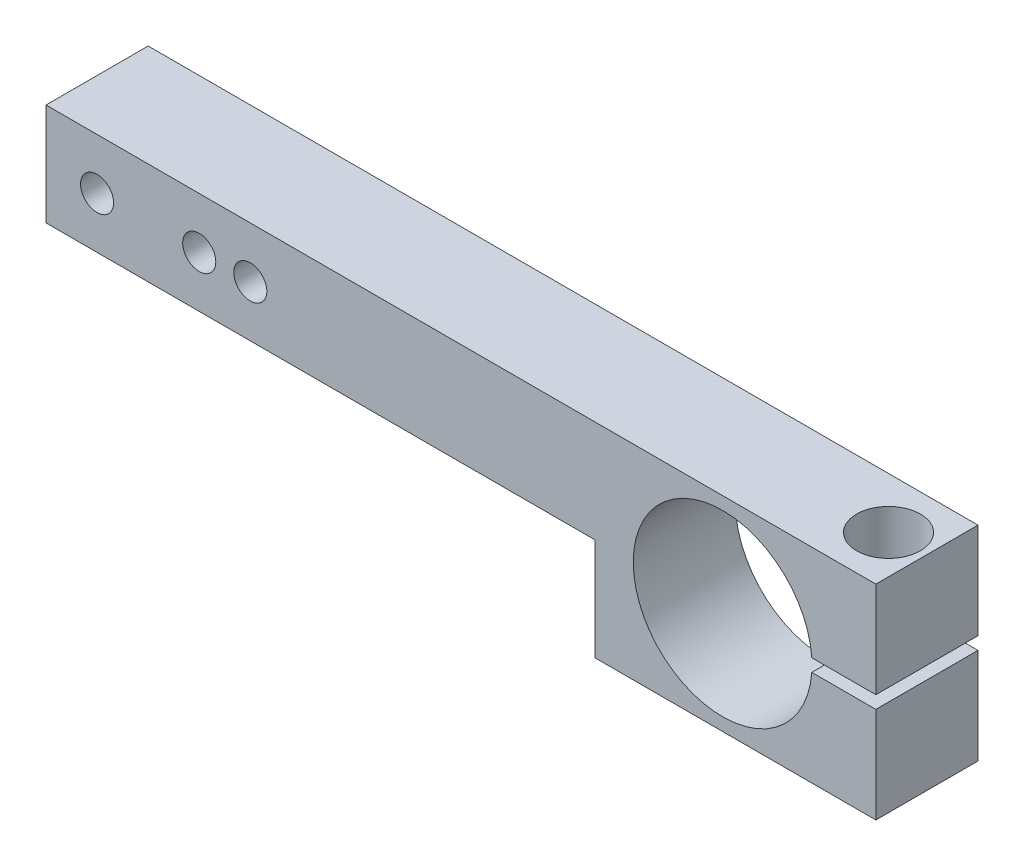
ISO-10303-21;
HEADER;
FILE_DESCRIPTION(('STEP AP214'),'2;1');
FILE_NAME('part.step','',(''),(''),'','','');
FILE_SCHEMA(('AUTOMOTIVE_DESIGN { 1 0 10303 214 1 1 1 1 }'));
ENDSEC;
DATA;
#1=APPLICATION_CONTEXT('core data for automotive mechanical design processes');
#2=APPLICATION_PROTOCOL_DEFINITION('international standard','automotive_design',2000,#1);
#3=PRODUCT_CONTEXT('',#1,'mechanical');
#4=PRODUCT('Part','Part','',(#3));
#5=PRODUCT_RELATED_PRODUCT_CATEGORY('part','',(#4));
#6=PRODUCT_DEFINITION_FORMATION('','',#4);
#7=PRODUCT_DEFINITION_CONTEXT('part definition',#1,'design');
#8=PRODUCT_DEFINITION('design','',#6,#7);
#9=PRODUCT_DEFINITION_SHAPE('','',#8);
#10=(LENGTH_UNIT() NAMED_UNIT(*) SI_UNIT(.MILLI.,.METRE.));
#11=(NAMED_UNIT(*) PLANE_ANGLE_UNIT() SI_UNIT($,.RADIAN.));
#12=(NAMED_UNIT(*) SI_UNIT($,.STERADIAN.) SOLID_ANGLE_UNIT());
#13=UNCERTAINTY_MEASURE_WITH_UNIT(LENGTH_MEASURE(1.E-05),#10,'distance_accuracy_value','');
#14=(GEOMETRIC_REPRESENTATION_CONTEXT(3) GLOBAL_UNCERTAINTY_ASSIGNED_CONTEXT((#13)) GLOBAL_UNIT_ASSIGNED_CONTEXT((#10,
#11,#12)) REPRESENTATION_CONTEXT('',''));
#15=CARTESIAN_POINT('',(0.,0.,0.));
#16=DIRECTION('',(0.,0.,1.));
#17=DIRECTION('',(1.,0.,0.));
#18=AXIS2_PLACEMENT_3D('',#15,#16,#17);
#19=CARTESIAN_POINT('',(19.05,0.,6.35));
#20=DIRECTION('',(-1.,0.,0.));
#21=DIRECTION('',(0.,-1.,0.));
#22=AXIS2_PLACEMENT_3D('',#19,#20,#21);
#23=PLANE('',#22);
#24=DIRECTION('',(0.,0.,1.));
#25=VECTOR('',#24,1.);
#26=CARTESIAN_POINT('',(19.05,0.7874,-6.35));
#27=LINE('',#26,#25);
#28=CARTESIAN_POINT('',(19.05,0.7874,-6.35));
#29=VERTEX_POINT('',#28);
#30=CARTESIAN_POINT('',(19.05,0.7874,6.35));
#31=VERTEX_POINT('',#30);
#32=EDGE_CURVE('E139',#29,#31,#27,.T.);
#33=ORIENTED_EDGE('',*,*,#32,.F.);
#34=DIRECTION('',(0.,1.,0.));
#35=VECTOR('',#34,1.);
#36=CARTESIAN_POINT('',(19.05,0.,-6.35));
#37=LINE('',#36,#35);
#38=CARTESIAN_POINT('',(19.05,12.7,-6.35));
#39=VERTEX_POINT('',#38);
#40=EDGE_CURVE('E166',#29,#39,#37,.T.);
#41=ORIENTED_EDGE('',*,*,#40,.T.);
#42=DIRECTION('',(0.,0.,-1.));
#43=VECTOR('',#42,1.);
#44=CARTESIAN_POINT('',(19.05,12.7,6.35));
#45=LINE('',#44,#43);
#46=CARTESIAN_POINT('',(19.05,12.7,6.35));
#47=VERTEX_POINT('',#46);
#48=EDGE_CURVE('E13',#47,#39,#45,.T.);
#49=ORIENTED_EDGE('',*,*,#48,.F.);
#50=DIRECTION('',(0.,1.,0.));
#51=VECTOR('',#50,1.);
#52=CARTESIAN_POINT('',(19.05,-12.7,6.35));
#53=LINE('',#52,#51);
#54=EDGE_CURVE('E148',#31,#47,#53,.T.);
#55=ORIENTED_EDGE('',*,*,#54,.F.);
#56=EDGE_LOOP('',(#33,#41,#49,#55));
#57=FACE_BOUND('',#56,.T.);
#58=ADVANCED_FACE('F45',(#57),#23,.F.);
#59=CARTESIAN_POINT('',(14.2748,12.7,0.));
#60=DIRECTION('',(0.,1.,0.));
#61=DIRECTION('',(0.,0.,1.));
#62=AXIS2_PLACEMENT_3D('',#59,#60,#61);
#63=CYLINDRICAL_SURFACE('',#62,2.3876);
#64=CARTESIAN_POINT('',(14.2748,6.35000000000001,0.));
#65=DIRECTION('',(0.,1.,0.));
#66=DIRECTION('',(0.,0.,1.));
#67=AXIS2_PLACEMENT_3D('',#64,#65,#66);
#68=CIRCLE('',#67,2.3876);
#69=CARTESIAN_POINT('',(14.2748,6.35000000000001,2.3876));
#70=VERTEX_POINT('',#69);
#71=EDGE_CURVE('E205',#70,#70,#68,.T.);
#72=ORIENTED_EDGE('',*,*,#71,.T.);
#73=EDGE_LOOP('',(#72));
#74=FACE_BOUND('',#73,.T.);
#75=CARTESIAN_POINT('',(14.2748,0.787399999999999,0.));
#76=DIRECTION('',(0.,-1.,0.));
#77=DIRECTION('',(1.,0.,0.));
#78=AXIS2_PLACEMENT_3D('',#75,#76,#77);
#79=CIRCLE('',#78,2.3876);
#80=CARTESIAN_POINT('',(16.6624,0.787399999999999,0.));
#81=VERTEX_POINT('',#80);
#82=EDGE_CURVE('E187',#81,#81,#79,.F.);
#83=ORIENTED_EDGE('',*,*,#82,.F.);
#84=EDGE_LOOP('',(#83));
#85=FACE_BOUND('',#84,.T.);
#86=ADVANCED_FACE('F277',(#74,#85),#63,.F.);
#87=CARTESIAN_POINT('',(0.,0.,6.35));
#88=DIRECTION('',(0.,0.,1.));
#89=DIRECTION('',(1.,0.,0.));
#90=AXIS2_PLACEMENT_3D('',#87,#88,#89);
#91=PLANE('',#90);
#92=DIRECTION('',(1.,0.,0.));
#93=VECTOR('',#92,1.);
#94=CARTESIAN_POINT('',(11.1125,-0.787400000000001,6.35));
#95=LINE('',#94,#93);
#96=CARTESIAN_POINT('',(11.0845684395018,-0.787400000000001,6.35));
#97=VERTEX_POINT('',#96);
#98=CARTESIAN_POINT('',(19.05,-0.7874,6.35));
#99=VERTEX_POINT('',#98);
#100=EDGE_CURVE('E122',#97,#99,#95,.T.);
#101=ORIENTED_EDGE('',*,*,#100,.F.);
#102=CARTESIAN_POINT('',(0.,0.,6.35));
#103=DIRECTION('',(0.,0.,1.));
#104=DIRECTION('',(1.,0.,0.));
#105=AXIS2_PLACEMENT_3D('',#102,#103,#104);
#106=CIRCLE('',#105,11.1125);
#107=CARTESIAN_POINT('',(11.0845684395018,0.787399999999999,6.35));
#108=VERTEX_POINT('',#107);
#109=EDGE_CURVE('E228',#108,#97,#106,.T.);
#110=ORIENTED_EDGE('',*,*,#109,.F.);
#111=DIRECTION('',(1.,0.,0.));
#112=VECTOR('',#111,1.);
#113=CARTESIAN_POINT('',(11.1125,0.787399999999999,6.35));
#114=LINE('',#113,#112);
#115=EDGE_CURVE('E70',#108,#31,#114,.T.);
#116=ORIENTED_EDGE('',*,*,#115,.T.);
#117=ORIENTED_EDGE('',*,*,#54,.T.);
#118=DIRECTION('',(-1.,0.,0.));
#119=VECTOR('',#118,1.);
#120=CARTESIAN_POINT('',(19.05,12.7,6.35));
#121=LINE('',#120,#119);
#122=CARTESIAN_POINT('',(-84.1248,12.7,6.35));
#123=VERTEX_POINT('',#122);
#124=EDGE_CURVE('E147',#47,#123,#121,.T.);
#125=ORIENTED_EDGE('',*,*,#124,.T.);
#126=DIRECTION('',(0.,-1.,0.));
#127=VECTOR('',#126,1.);
#128=CARTESIAN_POINT('',(-84.1248,12.7,6.35));
#129=LINE('',#128,#127);
#130=CARTESIAN_POINT('',(-84.1248,0.,6.35));
#131=VERTEX_POINT('',#130);
#132=EDGE_CURVE('E150',#123,#131,#129,.T.);
#133=ORIENTED_EDGE('',*,*,#132,.T.);
#134=DIRECTION('',(1.,0.,0.));
#135=VECTOR('',#134,1.);
#136=CARTESIAN_POINT('',(-84.1248,0.,6.35));
#137=LINE('',#136,#135);
#138=CARTESIAN_POINT('',(-15.875,0.,6.35));
#139=VERTEX_POINT('',#138);
#140=EDGE_CURVE('E158',#131,#139,#137,.T.);
#141=ORIENTED_EDGE('',*,*,#140,.T.);
#142=DIRECTION('',(0.,-1.,0.));
#143=VECTOR('',#142,1.);
#144=CARTESIAN_POINT('',(-15.875,0.,6.35));
#145=LINE('',#144,#143);
#146=CARTESIAN_POINT('',(-15.875,-12.7,6.35));
#147=VERTEX_POINT('',#146);
#148=EDGE_CURVE('E160',#139,#147,#145,.T.);
#149=ORIENTED_EDGE('',*,*,#148,.T.);
#150=DIRECTION('',(1.,0.,0.));
#151=VECTOR('',#150,1.);
#152=CARTESIAN_POINT('',(-15.875,-12.7,6.35));
#153=LINE('',#152,#151);
#154=CARTESIAN_POINT('',(19.05,-12.7,6.35));
#155=VERTEX_POINT('',#154);
#156=EDGE_CURVE('E145',#147,#155,#153,.T.);
#157=ORIENTED_EDGE('',*,*,#156,.T.);
#158=EDGE_CURVE('E137',#155,#99,#53,.T.);
#159=ORIENTED_EDGE('',*,*,#158,.T.);
#160=EDGE_LOOP('',(#101,#110,#116,#117,#125,#133,#141,#149,#157,#159));
#161=FACE_BOUND('',#160,.T.);
#162=CARTESIAN_POINT('',(-58.7248,6.34999999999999,6.35));
#163=DIRECTION('',(0.,0.,1.));
#164=DIRECTION('',(1.,0.,0.));
#165=AXIS2_PLACEMENT_3D('',#162,#163,#164);
#166=CIRCLE('',#165,2.0574);
#167=CARTESIAN_POINT('',(-56.6674,6.34999999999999,6.35));
#168=VERTEX_POINT('',#167);
#169=EDGE_CURVE('E218',#168,#168,#166,.T.);
#170=ORIENTED_EDGE('',*,*,#169,.F.);
#171=EDGE_LOOP('',(#170));
#172=FACE_BOUND('',#171,.T.);
#173=CARTESIAN_POINT('',(-77.7748,6.34999999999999,6.35));
#174=DIRECTION('',(0.,0.,1.));
#175=DIRECTION('',(1.,0.,0.));
#176=AXIS2_PLACEMENT_3D('',#173,#174,#175);
#177=CIRCLE('',#176,2.0574);
#178=CARTESIAN_POINT('',(-75.7174,6.34999999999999,6.35));
#179=VERTEX_POINT('',#178);
#180=EDGE_CURVE('E224',#179,#179,#177,.T.);
#181=ORIENTED_EDGE('',*,*,#180,.F.);
#182=EDGE_LOOP('',(#181));
#183=FACE_BOUND('',#182,.T.);
#184=CARTESIAN_POINT('',(-65.0748,6.34999999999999,6.35));
#185=DIRECTION('',(0.,0.,1.));
#186=DIRECTION('',(1.,0.,0.));
#187=AXIS2_PLACEMENT_3D('',#184,#185,#186);
#188=CIRCLE('',#187,2.0574);
#189=CARTESIAN_POINT('',(-63.0174,6.34999999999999,6.35));
#190=VERTEX_POINT('',#189);
#191=EDGE_CURVE('E212',#190,#190,#188,.T.);
#192=ORIENTED_EDGE('',*,*,#191,.F.);
#193=EDGE_LOOP('',(#192));
#194=FACE_BOUND('',#193,.T.);
#195=ADVANCED_FACE('F142',(#161,#172,#183,#194),#91,.T.);
#196=CARTESIAN_POINT('',(0.,0.,-6.35));
#197=DIRECTION('',(0.,0.,1.));
#198=DIRECTION('',(1.,0.,0.));
#199=AXIS2_PLACEMENT_3D('',#196,#197,#198);
#200=PLANE('',#199);
#201=CARTESIAN_POINT('',(-58.7248,6.34999999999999,-6.35));
#202=DIRECTION('',(0.,0.,1.));
#203=DIRECTION('',(1.,0.,0.));
#204=AXIS2_PLACEMENT_3D('',#201,#202,#203);
#205=CIRCLE('',#204,2.0574);
#206=CARTESIAN_POINT('',(-56.6674,6.34999999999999,-6.35));
#207=VERTEX_POINT('',#206);
#208=EDGE_CURVE('E215',#207,#207,#205,.T.);
#209=ORIENTED_EDGE('',*,*,#208,.T.);
#210=EDGE_LOOP('',(#209));
#211=FACE_BOUND('',#210,.T.);
#212=CARTESIAN_POINT('',(0.,0.,-6.35));
#213=DIRECTION('',(0.,0.,1.));
#214=DIRECTION('',(1.,0.,0.));
#215=AXIS2_PLACEMENT_3D('',#212,#213,#214);
#216=CIRCLE('',#215,11.1125);
#217=CARTESIAN_POINT('',(11.0845684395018,0.787399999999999,-6.35));
#218=VERTEX_POINT('',#217);
#219=CARTESIAN_POINT('',(11.0845684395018,-0.787400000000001,-6.35));
#220=VERTEX_POINT('',#219);
#221=EDGE_CURVE('E154',#218,#220,#216,.T.);
#222=ORIENTED_EDGE('',*,*,#221,.T.);
#223=DIRECTION('',(1.,0.,0.));
#224=VECTOR('',#223,1.);
#225=CARTESIAN_POINT('',(11.1125,-0.787400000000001,-6.35));
#226=LINE('',#225,#224);
#227=CARTESIAN_POINT('',(19.05,-0.7874,-6.35));
#228=VERTEX_POINT('',#227);
#229=EDGE_CURVE('E62',#220,#228,#226,.T.);
#230=ORIENTED_EDGE('',*,*,#229,.T.);
#231=CARTESIAN_POINT('',(19.05,-12.7,-6.35));
#232=VERTEX_POINT('',#231);
#233=EDGE_CURVE('E138',#232,#228,#37,.T.);
#234=ORIENTED_EDGE('',*,*,#233,.F.);
#235=DIRECTION('',(1.,0.,0.));
#236=VECTOR('',#235,1.);
#237=CARTESIAN_POINT('',(-15.875,-12.7,-6.35));
#238=LINE('',#237,#236);
#239=CARTESIAN_POINT('',(-15.875,-12.7,-6.35));
#240=VERTEX_POINT('',#239);
#241=EDGE_CURVE('E152',#240,#232,#238,.T.);
#242=ORIENTED_EDGE('',*,*,#241,.F.);
#243=DIRECTION('',(0.,-1.,0.));
#244=VECTOR('',#243,1.);
#245=CARTESIAN_POINT('',(-15.875,0.,-6.35));
#246=LINE('',#245,#244);
#247=CARTESIAN_POINT('',(-15.875,0.,-6.35));
#248=VERTEX_POINT('',#247);
#249=EDGE_CURVE('E172',#248,#240,#246,.T.);
#250=ORIENTED_EDGE('',*,*,#249,.F.);
#251=DIRECTION('',(1.,0.,0.));
#252=VECTOR('',#251,1.);
#253=CARTESIAN_POINT('',(-84.1248,0.,-6.35));
#254=LINE('',#253,#252);
#255=CARTESIAN_POINT('',(-84.1248,0.,-6.35));
#256=VERTEX_POINT('',#255);
#257=EDGE_CURVE('E170',#256,#248,#254,.T.);
#258=ORIENTED_EDGE('',*,*,#257,.F.);
#259=DIRECTION('',(0.,-1.,0.));
#260=VECTOR('',#259,1.);
#261=CARTESIAN_POINT('',(-84.1248,12.7,-6.35));
#262=LINE('',#261,#260);
#263=CARTESIAN_POINT('',(-84.1248,12.7,-6.35));
#264=VERTEX_POINT('',#263);
#265=EDGE_CURVE('E168',#264,#256,#262,.T.);
#266=ORIENTED_EDGE('',*,*,#265,.F.);
#267=DIRECTION('',(-1.,0.,0.));
#268=VECTOR('',#267,1.);
#269=CARTESIAN_POINT('',(19.05,12.7,-6.35));
#270=LINE('',#269,#268);
#271=EDGE_CURVE('E165',#39,#264,#270,.T.);
#272=ORIENTED_EDGE('',*,*,#271,.F.);
#273=ORIENTED_EDGE('',*,*,#40,.F.);
#274=DIRECTION('',(1.,0.,0.));
#275=VECTOR('',#274,1.);
#276=CARTESIAN_POINT('',(11.1125,0.787399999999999,-6.35));
#277=LINE('',#276,#275);
#278=EDGE_CURVE('E140',#218,#29,#277,.T.);
#279=ORIENTED_EDGE('',*,*,#278,.F.);
#280=EDGE_LOOP('',(#222,#230,#234,#242,#250,#258,#266,#272,#273,#279));
#281=FACE_BOUND('',#280,.T.);
#282=CARTESIAN_POINT('',(-77.7748,6.34999999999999,-6.35));
#283=DIRECTION('',(0.,0.,1.));
#284=DIRECTION('',(1.,0.,0.));
#285=AXIS2_PLACEMENT_3D('',#282,#283,#284);
#286=CIRCLE('',#285,2.0574);
#287=CARTESIAN_POINT('',(-75.7174,6.34999999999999,-6.35));
#288=VERTEX_POINT('',#287);
#289=EDGE_CURVE('E221',#288,#288,#286,.T.);
#290=ORIENTED_EDGE('',*,*,#289,.T.);
#291=EDGE_LOOP('',(#290));
#292=FACE_BOUND('',#291,.T.);
#293=CARTESIAN_POINT('',(-65.0748,6.34999999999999,-6.35));
#294=DIRECTION('',(0.,0.,1.));
#295=DIRECTION('',(1.,0.,0.));
#296=AXIS2_PLACEMENT_3D('',#293,#294,#295);
#297=CIRCLE('',#296,2.0574);
#298=CARTESIAN_POINT('',(-63.0174,6.34999999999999,-6.35));
#299=VERTEX_POINT('',#298);
#300=EDGE_CURVE('E211',#299,#299,#297,.T.);
#301=ORIENTED_EDGE('',*,*,#300,.T.);
#302=EDGE_LOOP('',(#301));
#303=FACE_BOUND('',#302,.T.);
#304=ADVANCED_FACE('F234',(#211,#281,#292,#303),#200,.F.);
#305=ORIENTED_EDGE('',*,*,#233,.T.);
#306=DIRECTION('',(0.,0.,1.));
#307=VECTOR('',#306,1.);
#308=CARTESIAN_POINT('',(19.05,-0.7874,-6.35));
#309=LINE('',#308,#307);
#310=EDGE_CURVE('E126',#228,#99,#309,.T.);
#311=ORIENTED_EDGE('',*,*,#310,.T.);
#312=ORIENTED_EDGE('',*,*,#158,.F.);
#313=DIRECTION('',(0.,0.,-1.));
#314=VECTOR('',#313,1.);
#315=CARTESIAN_POINT('',(19.05,-12.7,6.35));
#316=LINE('',#315,#314);
#317=EDGE_CURVE('E163',#155,#232,#316,.T.);
#318=ORIENTED_EDGE('',*,*,#317,.T.);
#319=EDGE_LOOP('',(#305,#311,#312,#318));
#320=FACE_BOUND('',#319,.T.);
#321=ADVANCED_FACE('F47',(#320),#23,.F.);
#322=CARTESIAN_POINT('',(19.05,12.7,6.35));
#323=DIRECTION('',(0.,-1.,0.));
#324=DIRECTION('',(1.,0.,0.));
#325=AXIS2_PLACEMENT_3D('',#322,#323,#324);
#326=PLANE('',#325);
#327=CARTESIAN_POINT('',(14.2748,12.7,0.));
#328=DIRECTION('',(0.,1.,0.));
#329=DIRECTION('',(0.,0.,1.));
#330=AXIS2_PLACEMENT_3D('',#327,#328,#329);
#331=CIRCLE('',#330,3.9624);
#332=CARTESIAN_POINT('',(14.2748,12.7,3.9624));
#333=VERTEX_POINT('',#332);
#334=EDGE_CURVE('E199',#333,#333,#331,.T.);
#335=ORIENTED_EDGE('',*,*,#334,.F.);
#336=EDGE_LOOP('',(#335));
#337=FACE_BOUND('',#336,.T.);
#338=ORIENTED_EDGE('',*,*,#271,.T.);
#339=DIRECTION('',(0.,0.,-1.));
#340=VECTOR('',#339,1.);
#341=CARTESIAN_POINT('',(-84.1248,12.7,6.35));
#342=LINE('',#341,#340);
#343=EDGE_CURVE('E54',#123,#264,#342,.T.);
#344=ORIENTED_EDGE('',*,*,#343,.F.);
#345=ORIENTED_EDGE('',*,*,#124,.F.);
#346=ORIENTED_EDGE('',*,*,#48,.T.);
#347=EDGE_LOOP('',(#338,#344,#345,#346));
#348=FACE_BOUND('',#347,.T.);
#349=ADVANCED_FACE('F246',(#337,#348),#326,.F.);
#350=CARTESIAN_POINT('',(-84.1248,12.7,6.35));
#351=DIRECTION('',(1.,0.,0.));
#352=DIRECTION('',(0.,0.,-1.));
#353=AXIS2_PLACEMENT_3D('',#350,#351,#352);
#354=PLANE('',#353);
#355=ORIENTED_EDGE('',*,*,#265,.T.);
#356=DIRECTION('',(0.,0.,-1.));
#357=VECTOR('',#356,1.);
#358=CARTESIAN_POINT('',(-84.1248,0.,6.35));
#359=LINE('',#358,#357);
#360=EDGE_CURVE('E183',#131,#256,#359,.T.);
#361=ORIENTED_EDGE('',*,*,#360,.F.);
#362=ORIENTED_EDGE('',*,*,#132,.F.);
#363=ORIENTED_EDGE('',*,*,#343,.T.);
#364=EDGE_LOOP('',(#355,#361,#362,#363));
#365=FACE_BOUND('',#364,.T.);
#366=ADVANCED_FACE('F252',(#365),#354,.F.);
#367=CARTESIAN_POINT('',(-84.1248,0.,6.35));
#368=DIRECTION('',(0.,1.,0.));
#369=DIRECTION('',(-1.,0.,0.));
#370=AXIS2_PLACEMENT_3D('',#367,#368,#369);
#371=PLANE('',#370);
#372=ORIENTED_EDGE('',*,*,#257,.T.);
#373=DIRECTION('',(0.,0.,-1.));
#374=VECTOR('',#373,1.);
#375=CARTESIAN_POINT('',(-15.875,0.,6.35));
#376=LINE('',#375,#374);
#377=EDGE_CURVE('E180',#139,#248,#376,.T.);
#378=ORIENTED_EDGE('',*,*,#377,.F.);
#379=ORIENTED_EDGE('',*,*,#140,.F.);
#380=ORIENTED_EDGE('',*,*,#360,.T.);
#381=EDGE_LOOP('',(#372,#378,#379,#380));
#382=FACE_BOUND('',#381,.T.);
#383=ADVANCED_FACE('F256',(#382),#371,.F.);
#384=CARTESIAN_POINT('',(-15.875,0.,6.35));
#385=DIRECTION('',(1.,0.,0.));
#386=DIRECTION('',(0.,0.,-1.));
#387=AXIS2_PLACEMENT_3D('',#384,#385,#386);
#388=PLANE('',#387);
#389=ORIENTED_EDGE('',*,*,#249,.T.);
#390=DIRECTION('',(0.,0.,-1.));
#391=VECTOR('',#390,1.);
#392=CARTESIAN_POINT('',(-15.875,-12.7,6.35));
#393=LINE('',#392,#391);
#394=EDGE_CURVE('E177',#147,#240,#393,.T.);
#395=ORIENTED_EDGE('',*,*,#394,.F.);
#396=ORIENTED_EDGE('',*,*,#148,.F.);
#397=ORIENTED_EDGE('',*,*,#377,.T.);
#398=EDGE_LOOP('',(#389,#395,#396,#397));
#399=FACE_BOUND('',#398,.T.);
#400=ADVANCED_FACE('F261',(#399),#388,.F.);
#401=CARTESIAN_POINT('',(-15.875,-12.7,6.35));
#402=DIRECTION('',(0.,1.,0.));
#403=DIRECTION('',(-1.,0.,0.));
#404=AXIS2_PLACEMENT_3D('',#401,#402,#403);
#405=PLANE('',#404);
#406=CARTESIAN_POINT('',(14.2748,-12.7,0.));
#407=DIRECTION('',(0.,1.,0.));
#408=DIRECTION('',(0.,0.,1.));
#409=AXIS2_PLACEMENT_3D('',#406,#407,#408);
#410=CIRCLE('',#409,2.38759999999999);
#411=CARTESIAN_POINT('',(14.2748,-12.7,2.38759999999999));
#412=VERTEX_POINT('',#411);
#413=EDGE_CURVE('E208',#412,#412,#410,.T.);
#414=ORIENTED_EDGE('',*,*,#413,.T.);
#415=EDGE_LOOP('',(#414));
#416=FACE_BOUND('',#415,.T.);
#417=ORIENTED_EDGE('',*,*,#241,.T.);
#418=ORIENTED_EDGE('',*,*,#317,.F.);
#419=ORIENTED_EDGE('',*,*,#156,.F.);
#420=ORIENTED_EDGE('',*,*,#394,.T.);
#421=EDGE_LOOP('',(#417,#418,#419,#420));
#422=FACE_BOUND('',#421,.T.);
#423=ADVANCED_FACE('F264',(#416,#422),#405,.F.);
#424=CARTESIAN_POINT('',(0.,0.,6.35));
#425=DIRECTION('',(0.,0.,-1.));
#426=DIRECTION('',(-1.,0.,0.));
#427=AXIS2_PLACEMENT_3D('',#424,#425,#426);
#428=CYLINDRICAL_SURFACE('',#427,11.1125);
#429=DIRECTION('',(0.,0.,-1.));
#430=VECTOR('',#429,1.);
#431=CARTESIAN_POINT('',(11.0845684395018,-0.787400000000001,6.35));
#432=LINE('',#431,#430);
#433=EDGE_CURVE('E127',#220,#97,#432,.F.);
#434=ORIENTED_EDGE('',*,*,#433,.F.);
#435=ORIENTED_EDGE('',*,*,#221,.F.);
#436=DIRECTION('',(0.,0.,-1.));
#437=VECTOR('',#436,1.);
#438=CARTESIAN_POINT('',(11.0845684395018,0.787399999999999,6.35));
#439=LINE('',#438,#437);
#440=EDGE_CURVE('E189',#218,#108,#439,.F.);
#441=ORIENTED_EDGE('',*,*,#440,.T.);
#442=ORIENTED_EDGE('',*,*,#109,.T.);
#443=EDGE_LOOP('',(#434,#435,#441,#442));
#444=FACE_BOUND('',#443,.T.);
#445=ADVANCED_FACE('F237',(#444),#428,.F.);
#446=CARTESIAN_POINT('',(-77.7748,6.34999999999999,6.35));
#447=DIRECTION('',(0.,0.,-1.));
#448=DIRECTION('',(-1.,0.,0.));
#449=AXIS2_PLACEMENT_3D('',#446,#447,#448);
#450=CYLINDRICAL_SURFACE('',#449,2.0574);
#451=ORIENTED_EDGE('',*,*,#180,.T.);
#452=EDGE_LOOP('',(#451));
#453=FACE_BOUND('',#452,.T.);
#454=ORIENTED_EDGE('',*,*,#289,.F.);
#455=EDGE_LOOP('',(#454));
#456=FACE_BOUND('',#455,.T.);
#457=ADVANCED_FACE('F272',(#453,#456),#450,.F.);
#458=CARTESIAN_POINT('',(-58.7248,6.34999999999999,6.35));
#459=DIRECTION('',(0.,0.,-1.));
#460=DIRECTION('',(-1.,0.,0.));
#461=AXIS2_PLACEMENT_3D('',#458,#459,#460);
#462=CYLINDRICAL_SURFACE('',#461,2.0574);
#463=ORIENTED_EDGE('',*,*,#169,.T.);
#464=EDGE_LOOP('',(#463));
#465=FACE_BOUND('',#464,.T.);
#466=ORIENTED_EDGE('',*,*,#208,.F.);
#467=EDGE_LOOP('',(#466));
#468=FACE_BOUND('',#467,.T.);
#469=ADVANCED_FACE('F298',(#465,#468),#462,.F.);
#470=CARTESIAN_POINT('',(-65.0748,6.34999999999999,6.35));
#471=DIRECTION('',(0.,0.,-1.));
#472=DIRECTION('',(-1.,0.,0.));
#473=AXIS2_PLACEMENT_3D('',#470,#471,#472);
#474=CYLINDRICAL_SURFACE('',#473,2.0574);
#475=ORIENTED_EDGE('',*,*,#191,.T.);
#476=EDGE_LOOP('',(#475));
#477=FACE_BOUND('',#476,.T.);
#478=ORIENTED_EDGE('',*,*,#300,.F.);
#479=EDGE_LOOP('',(#478));
#480=FACE_BOUND('',#479,.T.);
#481=ADVANCED_FACE('F302',(#477,#480),#474,.F.);
#482=CARTESIAN_POINT('',(14.2748,-0.787400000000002,0.));
#483=DIRECTION('',(0.,-1.,0.));
#484=DIRECTION('',(1.,0.,0.));
#485=AXIS2_PLACEMENT_3D('',#482,#483,#484);
#486=CIRCLE('',#485,2.3876);
#487=CARTESIAN_POINT('',(16.6624,-0.787400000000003,0.));
#488=VERTEX_POINT('',#487);
#489=EDGE_CURVE('E49',#488,#488,#486,.F.);
#490=ORIENTED_EDGE('',*,*,#489,.T.);
#491=EDGE_LOOP('',(#490));
#492=FACE_BOUND('',#491,.T.);
#493=ORIENTED_EDGE('',*,*,#413,.F.);
#494=EDGE_LOOP('',(#493));
#495=FACE_BOUND('',#494,.T.);
#496=ADVANCED_FACE('F283',(#492,#495),#63,.F.);
#497=CARTESIAN_POINT('',(16.6624,6.35000000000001,0.));
#498=DIRECTION('',(0.,-1.,0.));
#499=DIRECTION('',(0.,0.,-1.));
#500=AXIS2_PLACEMENT_3D('',#497,#498,#499);
#501=PLANE('',#500);
#502=ORIENTED_EDGE('',*,*,#71,.F.);
#503=EDGE_LOOP('',(#502));
#504=FACE_BOUND('',#503,.T.);
#505=CARTESIAN_POINT('',(14.2748,6.35000000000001,0.));
#506=DIRECTION('',(0.,1.,0.));
#507=DIRECTION('',(0.,0.,1.));
#508=AXIS2_PLACEMENT_3D('',#505,#506,#507);
#509=CIRCLE('',#508,3.9624);
#510=CARTESIAN_POINT('',(14.2748,6.35000000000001,3.9624));
#511=VERTEX_POINT('',#510);
#512=EDGE_CURVE('E202',#511,#511,#509,.T.);
#513=ORIENTED_EDGE('',*,*,#512,.T.);
#514=EDGE_LOOP('',(#513));
#515=FACE_BOUND('',#514,.T.);
#516=ADVANCED_FACE('F308',(#504,#515),#501,.F.);
#517=CARTESIAN_POINT('',(14.2748,12.7,0.));
#518=DIRECTION('',(0.,1.,0.));
#519=DIRECTION('',(0.,0.,1.));
#520=AXIS2_PLACEMENT_3D('',#517,#518,#519);
#521=CYLINDRICAL_SURFACE('',#520,3.9624);
#522=ORIENTED_EDGE('',*,*,#512,.F.);
#523=EDGE_LOOP('',(#522));
#524=FACE_BOUND('',#523,.T.);
#525=ORIENTED_EDGE('',*,*,#334,.T.);
#526=EDGE_LOOP('',(#525));
#527=FACE_BOUND('',#526,.T.);
#528=ADVANCED_FACE('F312',(#524,#527),#521,.F.);
#529=CARTESIAN_POINT('',(0.,0.7874,-6.35));
#530=DIRECTION('',(0.,-1.,0.));
#531=DIRECTION('',(1.,0.,0.));
#532=AXIS2_PLACEMENT_3D('',#529,#530,#531);
#533=PLANE('',#532);
#534=ORIENTED_EDGE('',*,*,#278,.T.);
#535=ORIENTED_EDGE('',*,*,#32,.T.);
#536=ORIENTED_EDGE('',*,*,#115,.F.);
#537=ORIENTED_EDGE('',*,*,#440,.F.);
#538=EDGE_LOOP('',(#534,#535,#536,#537));
#539=FACE_BOUND('',#538,.T.);
#540=ORIENTED_EDGE('',*,*,#82,.T.);
#541=EDGE_LOOP('',(#540));
#542=FACE_BOUND('',#541,.T.);
#543=ADVANCED_FACE('F316',(#539,#542),#533,.T.);
#544=CARTESIAN_POINT('',(0.,-0.7874,-6.35));
#545=DIRECTION('',(0.,-1.,0.));
#546=DIRECTION('',(1.,0.,0.));
#547=AXIS2_PLACEMENT_3D('',#544,#545,#546);
#548=PLANE('',#547);
#549=ORIENTED_EDGE('',*,*,#433,.T.);
#550=ORIENTED_EDGE('',*,*,#100,.T.);
#551=ORIENTED_EDGE('',*,*,#310,.F.);
#552=ORIENTED_EDGE('',*,*,#229,.F.);
#553=EDGE_LOOP('',(#549,#550,#551,#552));
#554=FACE_BOUND('',#553,.T.);
#555=ORIENTED_EDGE('',*,*,#489,.F.);
#556=EDGE_LOOP('',(#555));
#557=FACE_BOUND('',#556,.T.);
#558=ADVANCED_FACE('F124',(#554,#557),#548,.F.);
#559=CLOSED_SHELL('',(#58,#86,#195,#304,#321,#349,#366,#383,#400,#423,#445,#457,#469,#481,#496,
#516,#528,#543,#558));
#560=MANIFOLD_SOLID_BREP('B2',#559);
#561=ADVANCED_BREP_SHAPE_REPRESENTATION('',(#18,#560),#14);
#562=SHAPE_DEFINITION_REPRESENTATION(#9,#561);
ENDSEC;
END-ISO-10303-21;
